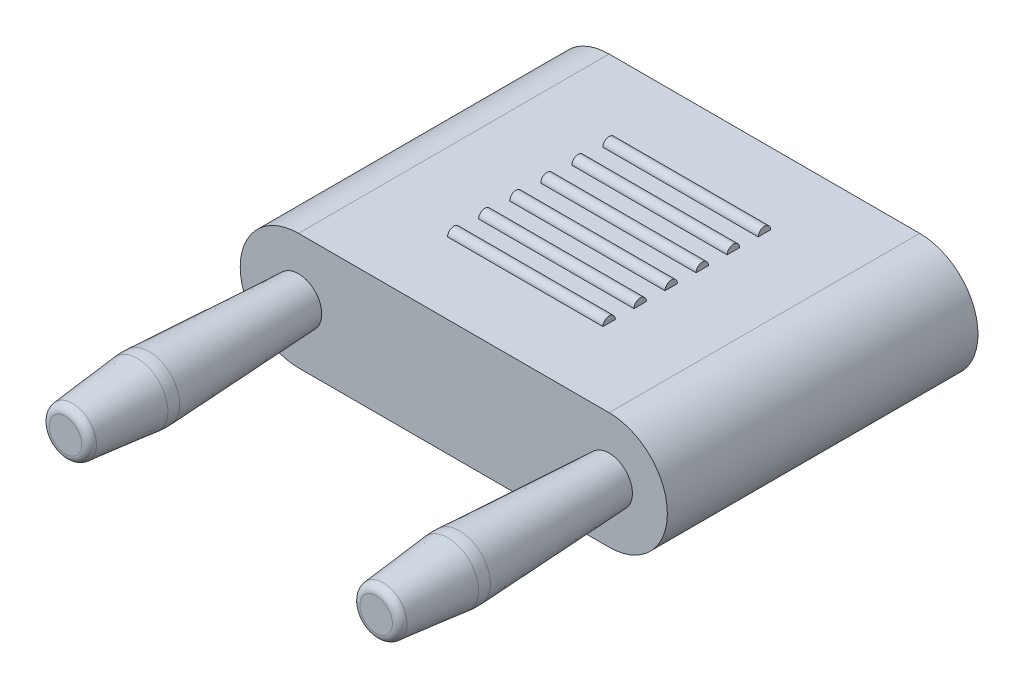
ISO-10303-21;
HEADER;
FILE_DESCRIPTION(('STEP AP214'),'2;1');
FILE_NAME('part.step','',(''),(''),'','','');
FILE_SCHEMA(('AUTOMOTIVE_DESIGN { 1 0 10303 214 1 1 1 1 }'));
ENDSEC;
DATA;
#1=APPLICATION_CONTEXT('core data for automotive mechanical design processes');
#2=APPLICATION_PROTOCOL_DEFINITION('international standard','automotive_design',2000,#1);
#3=PRODUCT_CONTEXT('',#1,'mechanical');
#4=PRODUCT('Part','Part','',(#3));
#5=PRODUCT_RELATED_PRODUCT_CATEGORY('part','',(#4));
#6=PRODUCT_DEFINITION_FORMATION('','',#4);
#7=PRODUCT_DEFINITION_CONTEXT('part definition',#1,'design');
#8=PRODUCT_DEFINITION('design','',#6,#7);
#9=PRODUCT_DEFINITION_SHAPE('','',#8);
#10=(LENGTH_UNIT() NAMED_UNIT(*) SI_UNIT(.MILLI.,.METRE.));
#11=(NAMED_UNIT(*) PLANE_ANGLE_UNIT() SI_UNIT($,.RADIAN.));
#12=(NAMED_UNIT(*) SI_UNIT($,.STERADIAN.) SOLID_ANGLE_UNIT());
#13=UNCERTAINTY_MEASURE_WITH_UNIT(LENGTH_MEASURE(1.E-05),#10,'distance_accuracy_value','');
#14=(GEOMETRIC_REPRESENTATION_CONTEXT(3) GLOBAL_UNCERTAINTY_ASSIGNED_CONTEXT((#13)) GLOBAL_UNIT_ASSIGNED_CONTEXT((#10,
#11,#12)) REPRESENTATION_CONTEXT('',''));
#15=CARTESIAN_POINT('',(0.,0.,0.));
#16=DIRECTION('',(0.,0.,1.));
#17=DIRECTION('',(1.,0.,0.));
#18=AXIS2_PLACEMENT_3D('',#15,#16,#17);
#19=CARTESIAN_POINT('',(-12.7,0.,25.4));
#20=DIRECTION('',(0.,0.,-1.));
#21=DIRECTION('',(-1.,0.,0.));
#22=AXIS2_PLACEMENT_3D('',#19,#20,#21);
#23=CYLINDRICAL_SURFACE('',#22,4.7625);
#24=CARTESIAN_POINT('',(-12.7,0.,0.));
#25=DIRECTION('',(0.,0.,1.));
#26=DIRECTION('',(1.,0.,0.));
#27=AXIS2_PLACEMENT_3D('',#24,#25,#26);
#28=CIRCLE('',#27,4.7625);
#29=CARTESIAN_POINT('',(-12.7,4.7625,0.));
#30=VERTEX_POINT('',#29);
#31=CARTESIAN_POINT('',(-12.7,-4.7625,0.));
#32=VERTEX_POINT('',#31);
#33=EDGE_CURVE('E279',#30,#32,#28,.T.);
#34=ORIENTED_EDGE('',*,*,#33,.T.);
#35=DIRECTION('',(0.,0.,-1.));
#36=VECTOR('',#35,1.);
#37=CARTESIAN_POINT('',(-12.7,-4.7625,25.4));
#38=LINE('',#37,#36);
#39=CARTESIAN_POINT('',(-12.7,-4.7625,25.4));
#40=VERTEX_POINT('',#39);
#41=EDGE_CURVE('E306',#40,#32,#38,.T.);
#42=ORIENTED_EDGE('',*,*,#41,.F.);
#43=CARTESIAN_POINT('',(-12.7,0.,25.4));
#44=DIRECTION('',(0.,0.,1.));
#45=DIRECTION('',(1.,0.,0.));
#46=AXIS2_PLACEMENT_3D('',#43,#44,#45);
#47=CIRCLE('',#46,4.7625);
#48=CARTESIAN_POINT('',(-12.7,4.7625,25.4));
#49=VERTEX_POINT('',#48);
#50=EDGE_CURVE('E280',#49,#40,#47,.T.);
#51=ORIENTED_EDGE('',*,*,#50,.F.);
#52=DIRECTION('',(0.,0.,-1.));
#53=VECTOR('',#52,1.);
#54=CARTESIAN_POINT('',(-12.7,4.7625,25.4));
#55=LINE('',#54,#53);
#56=EDGE_CURVE('E290',#49,#30,#55,.T.);
#57=ORIENTED_EDGE('',*,*,#56,.T.);
#58=EDGE_LOOP('',(#34,#42,#51,#57));
#59=FACE_BOUND('',#58,.T.);
#60=ADVANCED_FACE('F34',(#59),#23,.T.);
#61=CARTESIAN_POINT('',(-12.7,-4.7625,25.4));
#62=DIRECTION('',(0.,1.,0.));
#63=DIRECTION('',(-1.,0.,0.));
#64=AXIS2_PLACEMENT_3D('',#61,#62,#63);
#65=PLANE('',#64);
#66=DIRECTION('',(1.,0.,0.));
#67=VECTOR('',#66,1.);
#68=CARTESIAN_POINT('',(-12.7,-4.7625,0.));
#69=LINE('',#68,#67);
#70=CARTESIAN_POINT('',(12.7,-4.7625,0.));
#71=VERTEX_POINT('',#70);
#72=EDGE_CURVE('E293',#32,#71,#69,.T.);
#73=ORIENTED_EDGE('',*,*,#72,.T.);
#74=DIRECTION('',(0.,0.,-1.));
#75=VECTOR('',#74,1.);
#76=CARTESIAN_POINT('',(12.7,-4.7625,25.4));
#77=LINE('',#76,#75);
#78=CARTESIAN_POINT('',(12.7,-4.7625,25.4));
#79=VERTEX_POINT('',#78);
#80=EDGE_CURVE('E303',#79,#71,#77,.T.);
#81=ORIENTED_EDGE('',*,*,#80,.F.);
#82=DIRECTION('',(1.,0.,0.));
#83=VECTOR('',#82,1.);
#84=CARTESIAN_POINT('',(-12.7,-4.7625,25.4));
#85=LINE('',#84,#83);
#86=EDGE_CURVE('E283',#40,#79,#85,.T.);
#87=ORIENTED_EDGE('',*,*,#86,.F.);
#88=ORIENTED_EDGE('',*,*,#41,.T.);
#89=EDGE_LOOP('',(#73,#81,#87,#88));
#90=FACE_BOUND('',#89,.T.);
#91=ADVANCED_FACE('F327',(#90),#65,.F.);
#92=CARTESIAN_POINT('',(12.7,0.,25.4));
#93=DIRECTION('',(0.,0.,-1.));
#94=DIRECTION('',(-1.,0.,0.));
#95=AXIS2_PLACEMENT_3D('',#92,#93,#94);
#96=CYLINDRICAL_SURFACE('',#95,4.7625);
#97=CARTESIAN_POINT('',(12.7,0.,0.));
#98=DIRECTION('',(0.,0.,1.));
#99=DIRECTION('',(-1.,0.,0.));
#100=AXIS2_PLACEMENT_3D('',#97,#98,#99);
#101=CIRCLE('',#100,4.7625);
#102=CARTESIAN_POINT('',(12.7,4.7625,0.));
#103=VERTEX_POINT('',#102);
#104=EDGE_CURVE('E295',#71,#103,#101,.T.);
#105=ORIENTED_EDGE('',*,*,#104,.T.);
#106=DIRECTION('',(0.,0.,-1.));
#107=VECTOR('',#106,1.);
#108=CARTESIAN_POINT('',(12.7,4.7625,25.4));
#109=LINE('',#108,#107);
#110=CARTESIAN_POINT('',(12.7,4.7625,25.4));
#111=VERTEX_POINT('',#110);
#112=EDGE_CURVE('E300',#111,#103,#109,.T.);
#113=ORIENTED_EDGE('',*,*,#112,.F.);
#114=CARTESIAN_POINT('',(12.7,0.,25.4));
#115=DIRECTION('',(0.,0.,1.));
#116=DIRECTION('',(-1.,0.,0.));
#117=AXIS2_PLACEMENT_3D('',#114,#115,#116);
#118=CIRCLE('',#117,4.7625);
#119=EDGE_CURVE('E286',#79,#111,#118,.T.);
#120=ORIENTED_EDGE('',*,*,#119,.F.);
#121=ORIENTED_EDGE('',*,*,#80,.T.);
#122=EDGE_LOOP('',(#105,#113,#120,#121));
#123=FACE_BOUND('',#122,.T.);
#124=ADVANCED_FACE('F332',(#123),#96,.T.);
#125=CARTESIAN_POINT('',(-12.7,4.7625,25.4));
#126=DIRECTION('',(0.,-1.,0.));
#127=DIRECTION('',(0.,0.,-1.));
#128=AXIS2_PLACEMENT_3D('',#125,#126,#127);
#129=PLANE('',#128);
#130=DIRECTION('',(-1.,0.,0.));
#131=VECTOR('',#130,1.);
#132=CARTESIAN_POINT('',(6.35,4.7625,5.842));
#133=LINE('',#132,#131);
#134=CARTESIAN_POINT('',(6.35,4.7625,5.842));
#135=VERTEX_POINT('',#134);
#136=CARTESIAN_POINT('',(-6.35,4.7625,5.842));
#137=VERTEX_POINT('',#136);
#138=EDGE_CURVE('E53',#135,#137,#133,.T.);
#139=ORIENTED_EDGE('',*,*,#138,.F.);
#140=DIRECTION('',(0.,0.,-1.));
#141=VECTOR('',#140,1.);
#142=CARTESIAN_POINT('',(6.35,4.7625,6.858));
#143=LINE('',#142,#141);
#144=CARTESIAN_POINT('',(6.35,4.7625,6.858));
#145=VERTEX_POINT('',#144);
#146=EDGE_CURVE('E48',#145,#135,#143,.T.);
#147=ORIENTED_EDGE('',*,*,#146,.F.);
#148=DIRECTION('',(-1.,0.,0.));
#149=VECTOR('',#148,1.);
#150=CARTESIAN_POINT('',(6.35,4.7625,6.858));
#151=LINE('',#150,#149);
#152=CARTESIAN_POINT('',(-6.35,4.7625,6.858));
#153=VERTEX_POINT('',#152);
#154=EDGE_CURVE('E142',#145,#153,#151,.T.);
#155=ORIENTED_EDGE('',*,*,#154,.T.);
#156=DIRECTION('',(0.,0.,-1.));
#157=VECTOR('',#156,1.);
#158=CARTESIAN_POINT('',(-6.35,4.7625,6.858));
#159=LINE('',#158,#157);
#160=EDGE_CURVE('E146',#153,#137,#159,.T.);
#161=ORIENTED_EDGE('',*,*,#160,.T.);
#162=EDGE_LOOP('',(#139,#147,#155,#161));
#163=FACE_BOUND('',#162,.T.);
#164=DIRECTION('',(-1.,0.,0.));
#165=VECTOR('',#164,1.);
#166=CARTESIAN_POINT('',(6.35,4.7625,8.382));
#167=LINE('',#166,#165);
#168=CARTESIAN_POINT('',(6.35,4.7625,8.382));
#169=VERTEX_POINT('',#168);
#170=CARTESIAN_POINT('',(-6.35,4.7625,8.382));
#171=VERTEX_POINT('',#170);
#172=EDGE_CURVE('E171',#169,#171,#167,.T.);
#173=ORIENTED_EDGE('',*,*,#172,.F.);
#174=DIRECTION('',(0.,0.,-1.));
#175=VECTOR('',#174,1.);
#176=CARTESIAN_POINT('',(6.35,4.7625,9.39800000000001));
#177=LINE('',#176,#175);
#178=CARTESIAN_POINT('',(6.35,4.7625,9.39800000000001));
#179=VERTEX_POINT('',#178);
#180=EDGE_CURVE('E167',#179,#169,#177,.T.);
#181=ORIENTED_EDGE('',*,*,#180,.F.);
#182=DIRECTION('',(-1.,0.,0.));
#183=VECTOR('',#182,1.);
#184=CARTESIAN_POINT('',(6.35,4.7625,9.39800000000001));
#185=LINE('',#184,#183);
#186=CARTESIAN_POINT('',(-6.35,4.7625,9.39800000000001));
#187=VERTEX_POINT('',#186);
#188=EDGE_CURVE('E177',#179,#187,#185,.T.);
#189=ORIENTED_EDGE('',*,*,#188,.T.);
#190=DIRECTION('',(0.,0.,-1.));
#191=VECTOR('',#190,1.);
#192=CARTESIAN_POINT('',(-6.35,4.7625,9.39800000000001));
#193=LINE('',#192,#191);
#194=EDGE_CURVE('E168',#187,#171,#193,.T.);
#195=ORIENTED_EDGE('',*,*,#194,.T.);
#196=EDGE_LOOP('',(#173,#181,#189,#195));
#197=FACE_BOUND('',#196,.T.);
#198=DIRECTION('',(-1.,0.,0.));
#199=VECTOR('',#198,1.);
#200=CARTESIAN_POINT('',(6.35,4.7625,10.922));
#201=LINE('',#200,#199);
#202=CARTESIAN_POINT('',(6.35,4.7625,10.922));
#203=VERTEX_POINT('',#202);
#204=CARTESIAN_POINT('',(-6.35,4.7625,10.922));
#205=VERTEX_POINT('',#204);
#206=EDGE_CURVE('E187',#203,#205,#201,.T.);
#207=ORIENTED_EDGE('',*,*,#206,.F.);
#208=DIRECTION('',(0.,0.,-1.));
#209=VECTOR('',#208,1.);
#210=CARTESIAN_POINT('',(6.35,4.7625,11.938));
#211=LINE('',#210,#209);
#212=CARTESIAN_POINT('',(6.35,4.7625,11.938));
#213=VERTEX_POINT('',#212);
#214=EDGE_CURVE('E183',#213,#203,#211,.T.);
#215=ORIENTED_EDGE('',*,*,#214,.F.);
#216=DIRECTION('',(-1.,0.,0.));
#217=VECTOR('',#216,1.);
#218=CARTESIAN_POINT('',(6.35,4.7625,11.938));
#219=LINE('',#218,#217);
#220=CARTESIAN_POINT('',(-6.35,4.7625,11.938));
#221=VERTEX_POINT('',#220);
#222=EDGE_CURVE('E193',#213,#221,#219,.T.);
#223=ORIENTED_EDGE('',*,*,#222,.T.);
#224=DIRECTION('',(0.,0.,-1.));
#225=VECTOR('',#224,1.);
#226=CARTESIAN_POINT('',(-6.35,4.7625,11.938));
#227=LINE('',#226,#225);
#228=EDGE_CURVE('E184',#221,#205,#227,.T.);
#229=ORIENTED_EDGE('',*,*,#228,.T.);
#230=EDGE_LOOP('',(#207,#215,#223,#229));
#231=FACE_BOUND('',#230,.T.);
#232=DIRECTION('',(-1.,0.,0.));
#233=VECTOR('',#232,1.);
#234=CARTESIAN_POINT('',(6.35,4.7625,13.462));
#235=LINE('',#234,#233);
#236=CARTESIAN_POINT('',(6.35,4.7625,13.462));
#237=VERTEX_POINT('',#236);
#238=CARTESIAN_POINT('',(-6.35,4.7625,13.462));
#239=VERTEX_POINT('',#238);
#240=EDGE_CURVE('E203',#237,#239,#235,.T.);
#241=ORIENTED_EDGE('',*,*,#240,.F.);
#242=DIRECTION('',(0.,0.,-1.));
#243=VECTOR('',#242,1.);
#244=CARTESIAN_POINT('',(6.35,4.7625,14.478));
#245=LINE('',#244,#243);
#246=CARTESIAN_POINT('',(6.35,4.7625,14.478));
#247=VERTEX_POINT('',#246);
#248=EDGE_CURVE('E199',#247,#237,#245,.T.);
#249=ORIENTED_EDGE('',*,*,#248,.F.);
#250=DIRECTION('',(-1.,0.,0.));
#251=VECTOR('',#250,1.);
#252=CARTESIAN_POINT('',(6.35,4.7625,14.478));
#253=LINE('',#252,#251);
#254=CARTESIAN_POINT('',(-6.35,4.7625,14.478));
#255=VERTEX_POINT('',#254);
#256=EDGE_CURVE('E209',#247,#255,#253,.T.);
#257=ORIENTED_EDGE('',*,*,#256,.T.);
#258=DIRECTION('',(0.,0.,-1.));
#259=VECTOR('',#258,1.);
#260=CARTESIAN_POINT('',(-6.35,4.7625,14.478));
#261=LINE('',#260,#259);
#262=EDGE_CURVE('E200',#255,#239,#261,.T.);
#263=ORIENTED_EDGE('',*,*,#262,.T.);
#264=EDGE_LOOP('',(#241,#249,#257,#263));
#265=FACE_BOUND('',#264,.T.);
#266=DIRECTION('',(-1.,0.,0.));
#267=VECTOR('',#266,1.);
#268=CARTESIAN_POINT('',(6.35,4.7625,16.002));
#269=LINE('',#268,#267);
#270=CARTESIAN_POINT('',(6.35,4.7625,16.002));
#271=VERTEX_POINT('',#270);
#272=CARTESIAN_POINT('',(-6.35,4.7625,16.002));
#273=VERTEX_POINT('',#272);
#274=EDGE_CURVE('E219',#271,#273,#269,.T.);
#275=ORIENTED_EDGE('',*,*,#274,.F.);
#276=DIRECTION('',(0.,0.,-1.));
#277=VECTOR('',#276,1.);
#278=CARTESIAN_POINT('',(6.35,4.7625,17.018));
#279=LINE('',#278,#277);
#280=CARTESIAN_POINT('',(6.35,4.7625,17.018));
#281=VERTEX_POINT('',#280);
#282=EDGE_CURVE('E215',#281,#271,#279,.T.);
#283=ORIENTED_EDGE('',*,*,#282,.F.);
#284=DIRECTION('',(-1.,0.,0.));
#285=VECTOR('',#284,1.);
#286=CARTESIAN_POINT('',(6.35,4.7625,17.018));
#287=LINE('',#286,#285);
#288=CARTESIAN_POINT('',(-6.35,4.7625,17.018));
#289=VERTEX_POINT('',#288);
#290=EDGE_CURVE('E225',#281,#289,#287,.T.);
#291=ORIENTED_EDGE('',*,*,#290,.T.);
#292=DIRECTION('',(0.,0.,-1.));
#293=VECTOR('',#292,1.);
#294=CARTESIAN_POINT('',(-6.35,4.7625,17.018));
#295=LINE('',#294,#293);
#296=EDGE_CURVE('E216',#289,#273,#295,.T.);
#297=ORIENTED_EDGE('',*,*,#296,.T.);
#298=EDGE_LOOP('',(#275,#283,#291,#297));
#299=FACE_BOUND('',#298,.T.);
#300=DIRECTION('',(-1.,0.,0.));
#301=VECTOR('',#300,1.);
#302=CARTESIAN_POINT('',(6.35,4.7625,18.542));
#303=LINE('',#302,#301);
#304=CARTESIAN_POINT('',(6.35,4.7625,18.542));
#305=VERTEX_POINT('',#304);
#306=CARTESIAN_POINT('',(-6.35,4.7625,18.542));
#307=VERTEX_POINT('',#306);
#308=EDGE_CURVE('E235',#305,#307,#303,.T.);
#309=ORIENTED_EDGE('',*,*,#308,.F.);
#310=DIRECTION('',(0.,0.,-1.));
#311=VECTOR('',#310,1.);
#312=CARTESIAN_POINT('',(6.35,4.7625,19.558));
#313=LINE('',#312,#311);
#314=CARTESIAN_POINT('',(6.35,4.7625,19.558));
#315=VERTEX_POINT('',#314);
#316=EDGE_CURVE('E231',#315,#305,#313,.T.);
#317=ORIENTED_EDGE('',*,*,#316,.F.);
#318=DIRECTION('',(-1.,0.,0.));
#319=VECTOR('',#318,1.);
#320=CARTESIAN_POINT('',(6.35,4.7625,19.558));
#321=LINE('',#320,#319);
#322=CARTESIAN_POINT('',(-6.35,4.7625,19.558));
#323=VERTEX_POINT('',#322);
#324=EDGE_CURVE('E241',#315,#323,#321,.T.);
#325=ORIENTED_EDGE('',*,*,#324,.T.);
#326=DIRECTION('',(0.,0.,-1.));
#327=VECTOR('',#326,1.);
#328=CARTESIAN_POINT('',(-6.35,4.7625,19.558));
#329=LINE('',#328,#327);
#330=EDGE_CURVE('E232',#323,#307,#329,.T.);
#331=ORIENTED_EDGE('',*,*,#330,.T.);
#332=EDGE_LOOP('',(#309,#317,#325,#331));
#333=FACE_BOUND('',#332,.T.);
#334=DIRECTION('',(-1.,0.,0.));
#335=VECTOR('',#334,1.);
#336=CARTESIAN_POINT('',(-12.7,4.7625,0.));
#337=LINE('',#336,#335);
#338=EDGE_CURVE('E284',#103,#30,#337,.T.);
#339=ORIENTED_EDGE('',*,*,#338,.T.);
#340=ORIENTED_EDGE('',*,*,#56,.F.);
#341=DIRECTION('',(-1.,0.,0.));
#342=VECTOR('',#341,1.);
#343=CARTESIAN_POINT('',(-12.7,4.7625,25.4));
#344=LINE('',#343,#342);
#345=EDGE_CURVE('E288',#111,#49,#344,.T.);
#346=ORIENTED_EDGE('',*,*,#345,.F.);
#347=ORIENTED_EDGE('',*,*,#112,.T.);
#348=EDGE_LOOP('',(#339,#340,#346,#347));
#349=FACE_BOUND('',#348,.T.);
#350=ADVANCED_FACE('F144',(#163,#197,#231,#265,#299,#333,#349),#129,.F.);
#351=CARTESIAN_POINT('',(-12.7,0.,25.4));
#352=DIRECTION('',(0.,0.,1.));
#353=DIRECTION('',(1.,0.,0.));
#354=AXIS2_PLACEMENT_3D('',#351,#352,#353);
#355=PLANE('',#354);
#356=CARTESIAN_POINT('',(12.7,0.,25.4));
#357=DIRECTION('',(0.,0.,1.));
#358=DIRECTION('',(1.,0.,0.));
#359=AXIS2_PLACEMENT_3D('',#356,#357,#358);
#360=CIRCLE('',#359,1.905);
#361=CARTESIAN_POINT('',(14.605,0.,25.4));
#362=VERTEX_POINT('',#361);
#363=EDGE_CURVE('E11',#362,#362,#360,.T.);
#364=ORIENTED_EDGE('',*,*,#363,.F.);
#365=EDGE_LOOP('',(#364));
#366=FACE_BOUND('',#365,.T.);
#367=CARTESIAN_POINT('',(-12.7,0.,25.4));
#368=DIRECTION('',(0.,0.,1.));
#369=DIRECTION('',(1.,0.,0.));
#370=AXIS2_PLACEMENT_3D('',#367,#368,#369);
#371=CIRCLE('',#370,1.905);
#372=CARTESIAN_POINT('',(-10.795,0.,25.4));
#373=VERTEX_POINT('',#372);
#374=EDGE_CURVE('E41',#373,#373,#371,.T.);
#375=ORIENTED_EDGE('',*,*,#374,.F.);
#376=EDGE_LOOP('',(#375));
#377=FACE_BOUND('',#376,.T.);
#378=ORIENTED_EDGE('',*,*,#50,.T.);
#379=ORIENTED_EDGE('',*,*,#86,.T.);
#380=ORIENTED_EDGE('',*,*,#119,.T.);
#381=ORIENTED_EDGE('',*,*,#345,.T.);
#382=EDGE_LOOP('',(#378,#379,#380,#381));
#383=FACE_BOUND('',#382,.T.);
#384=ADVANCED_FACE('F313',(#366,#377,#383),#355,.T.);
#385=CARTESIAN_POINT('',(-12.7,0.,0.));
#386=DIRECTION('',(0.,0.,1.));
#387=DIRECTION('',(1.,0.,0.));
#388=AXIS2_PLACEMENT_3D('',#385,#386,#387);
#389=PLANE('',#388);
#390=CARTESIAN_POINT('',(12.7,0.,0.));
#391=DIRECTION('',(0.,0.,-1.));
#392=DIRECTION('',(-1.,0.,0.));
#393=AXIS2_PLACEMENT_3D('',#390,#391,#392);
#394=CIRCLE('',#393,1.905);
#395=CARTESIAN_POINT('',(10.795,0.,0.));
#396=VERTEX_POINT('',#395);
#397=EDGE_CURVE('E243',#396,#396,#394,.T.);
#398=ORIENTED_EDGE('',*,*,#397,.F.);
#399=EDGE_LOOP('',(#398));
#400=FACE_BOUND('',#399,.T.);
#401=CARTESIAN_POINT('',(-12.7,0.,0.));
#402=DIRECTION('',(0.,0.,-1.));
#403=DIRECTION('',(-1.,0.,0.));
#404=AXIS2_PLACEMENT_3D('',#401,#402,#403);
#405=CIRCLE('',#404,1.905);
#406=CARTESIAN_POINT('',(-14.605,0.,0.));
#407=VERTEX_POINT('',#406);
#408=EDGE_CURVE('E261',#407,#407,#405,.T.);
#409=ORIENTED_EDGE('',*,*,#408,.F.);
#410=EDGE_LOOP('',(#409));
#411=FACE_BOUND('',#410,.T.);
#412=ORIENTED_EDGE('',*,*,#33,.F.);
#413=ORIENTED_EDGE('',*,*,#338,.F.);
#414=ORIENTED_EDGE('',*,*,#104,.F.);
#415=ORIENTED_EDGE('',*,*,#72,.F.);
#416=EDGE_LOOP('',(#412,#413,#414,#415));
#417=FACE_BOUND('',#416,.T.);
#418=ADVANCED_FACE('F316',(#400,#411,#417),#389,.F.);
#419=CARTESIAN_POINT('',(-14.0303328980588,0.,44.45));
#420=DIRECTION('',(0.,0.,1.));
#421=DIRECTION('',(1.,0.,0.));
#422=AXIS2_PLACEMENT_3D('',#419,#420,#421);
#423=PLANE('',#422);
#424=CARTESIAN_POINT('',(-12.7,0.,44.45));
#425=DIRECTION('',(0.,0.,-1.));
#426=DIRECTION('',(-1.,0.,0.));
#427=AXIS2_PLACEMENT_3D('',#424,#425,#426);
#428=CIRCLE('',#427,1.33033289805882);
#429=CARTESIAN_POINT('',(-14.0303328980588,0.,44.45));
#430=VERTEX_POINT('',#429);
#431=EDGE_CURVE('E276',#430,#430,#428,.T.);
#432=ORIENTED_EDGE('',*,*,#431,.F.);
#433=EDGE_LOOP('',(#432));
#434=FACE_BOUND('',#433,.T.);
#435=ADVANCED_FACE('F337',(#434),#423,.T.);
#436=CARTESIAN_POINT('',(-12.7,0.,43.815));
#437=DIRECTION('',(0.,0.,-1.));
#438=DIRECTION('',(-1.,0.,0.));
#439=AXIS2_PLACEMENT_3D('',#436,#437,#438);
#440=TOROIDAL_SURFACE('',#439,1.33033289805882,0.634999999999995);
#441=ORIENTED_EDGE('',*,*,#431,.T.);
#442=EDGE_LOOP('',(#441));
#443=FACE_BOUND('',#442,.T.);
#444=CARTESIAN_POINT('',(-12.7,0.,43.8781848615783));
#445=DIRECTION('',(0.,0.,-1.));
#446=DIRECTION('',(-1.,0.,0.));
#447=AXIS2_PLACEMENT_3D('',#444,#445,#446);
#448=CIRCLE('',#447,1.96218151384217);
#449=CARTESIAN_POINT('',(-14.6621815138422,0.,43.8781848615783));
#450=VERTEX_POINT('',#449);
#451=EDGE_CURVE('E273',#450,#450,#448,.T.);
#452=ORIENTED_EDGE('',*,*,#451,.F.);
#453=EDGE_LOOP('',(#452));
#454=FACE_BOUND('',#453,.T.);
#455=ADVANCED_FACE('F343',(#443,#454),#440,.T.);
#456=CARTESIAN_POINT('',(-12.7,0.,38.5735921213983));
#457=DIRECTION('',(0.,0.,-1.));
#458=DIRECTION('',(-1.,0.,0.));
#459=AXIS2_PLACEMENT_3D('',#456,#457,#458);
#460=CONICAL_SURFACE('',#459,2.49264078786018,0.099668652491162);
#461=ORIENTED_EDGE('',*,*,#451,.T.);
#462=EDGE_LOOP('',(#461));
#463=FACE_BOUND('',#462,.T.);
#464=CARTESIAN_POINT('',(-12.7,0.,38.5735921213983));
#465=DIRECTION('',(0.,0.,-1.));
#466=DIRECTION('',(-1.,0.,0.));
#467=AXIS2_PLACEMENT_3D('',#464,#465,#466);
#468=CIRCLE('',#467,2.49264078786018);
#469=CARTESIAN_POINT('',(-15.1926407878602,0.,38.5735921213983));
#470=VERTEX_POINT('',#469);
#471=EDGE_CURVE('E270',#470,#470,#468,.T.);
#472=ORIENTED_EDGE('',*,*,#471,.F.);
#473=EDGE_LOOP('',(#472));
#474=FACE_BOUND('',#473,.T.);
#475=ADVANCED_FACE('F644',(#463,#474),#460,.T.);
#476=CARTESIAN_POINT('',(-12.7,0.,37.9417435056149));
#477=DIRECTION('',(0.,0.,-1.));
#478=DIRECTION('',(-1.,0.,0.));
#479=AXIS2_PLACEMENT_3D('',#476,#477,#478);
#480=DEGENERATE_TOROIDAL_SURFACE('',#479,3.82584536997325,6.35,.F.);
#481=ORIENTED_EDGE('',*,*,#471,.T.);
#482=EDGE_LOOP('',(#481));
#483=FACE_BOUND('',#482,.T.);
#484=CARTESIAN_POINT('',(-12.7,0.,37.6246396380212));
#485=DIRECTION('',(0.,0.,-1.));
#486=DIRECTION('',(-1.,0.,0.));
#487=AXIS2_PLACEMENT_3D('',#484,#485,#486);
#488=CIRCLE('',#487,2.51623198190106);
#489=CARTESIAN_POINT('',(-15.2162319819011,0.,37.6246396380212));
#490=VERTEX_POINT('',#489);
#491=EDGE_CURVE('E265',#490,#490,#488,.T.);
#492=ORIENTED_EDGE('',*,*,#491,.F.);
#493=EDGE_LOOP('',(#492));
#494=FACE_BOUND('',#493,.T.);
#495=ADVANCED_FACE('F640',(#483,#494),#480,.F.);
#496=CARTESIAN_POINT('',(-12.7,0.,25.4));
#497=DIRECTION('',(0.,0.,1.));
#498=DIRECTION('',(1.,0.,0.));
#499=AXIS2_PLACEMENT_3D('',#496,#497,#498);
#500=CONICAL_SURFACE('',#499,1.905,0.0499583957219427);
#501=ORIENTED_EDGE('',*,*,#491,.T.);
#502=EDGE_LOOP('',(#501));
#503=FACE_BOUND('',#502,.T.);
#504=ORIENTED_EDGE('',*,*,#374,.T.);
#505=EDGE_LOOP('',(#504));
#506=FACE_BOUND('',#505,.T.);
#507=ADVANCED_FACE('F311',(#503,#506),#500,.T.);
#508=CARTESIAN_POINT('',(-12.7,0.,6.35));
#509=DIRECTION('',(0.,0.,-1.));
#510=DIRECTION('',(-1.,0.,0.));
#511=AXIS2_PLACEMENT_3D('',#508,#509,#510);
#512=CYLINDRICAL_SURFACE('',#511,1.905);
#513=CARTESIAN_POINT('',(-12.7,0.,6.35));
#514=DIRECTION('',(0.,0.,-1.));
#515=DIRECTION('',(-1.,0.,0.));
#516=AXIS2_PLACEMENT_3D('',#513,#514,#515);
#517=CIRCLE('',#516,1.905);
#518=CARTESIAN_POINT('',(-14.605,0.,6.35));
#519=VERTEX_POINT('',#518);
#520=EDGE_CURVE('E262',#519,#519,#517,.T.);
#521=ORIENTED_EDGE('',*,*,#520,.F.);
#522=EDGE_LOOP('',(#521));
#523=FACE_BOUND('',#522,.T.);
#524=ORIENTED_EDGE('',*,*,#408,.T.);
#525=EDGE_LOOP('',(#524));
#526=FACE_BOUND('',#525,.T.);
#527=ADVANCED_FACE('F633',(#523,#526),#512,.F.);
#528=CARTESIAN_POINT('',(-12.7,0.,6.35));
#529=DIRECTION('',(0.,0.,-1.));
#530=DIRECTION('',(-1.,0.,0.));
#531=AXIS2_PLACEMENT_3D('',#528,#529,#530);
#532=PLANE('',#531);
#533=ORIENTED_EDGE('',*,*,#520,.T.);
#534=EDGE_LOOP('',(#533));
#535=FACE_BOUND('',#534,.T.);
#536=ADVANCED_FACE('F374',(#535),#532,.T.);
#537=CARTESIAN_POINT('',(11.3696671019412,0.,44.45));
#538=DIRECTION('',(0.,0.,1.));
#539=DIRECTION('',(1.,0.,0.));
#540=AXIS2_PLACEMENT_3D('',#537,#538,#539);
#541=PLANE('',#540);
#542=CARTESIAN_POINT('',(12.7,0.,44.45));
#543=DIRECTION('',(0.,0.,-1.));
#544=DIRECTION('',(-1.,0.,0.));
#545=AXIS2_PLACEMENT_3D('',#542,#543,#544);
#546=CIRCLE('',#545,1.33033289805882);
#547=CARTESIAN_POINT('',(11.3696671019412,0.,44.45));
#548=VERTEX_POINT('',#547);
#549=EDGE_CURVE('E258',#548,#548,#546,.T.);
#550=ORIENTED_EDGE('',*,*,#549,.F.);
#551=EDGE_LOOP('',(#550));
#552=FACE_BOUND('',#551,.T.);
#553=ADVANCED_FACE('F384',(#552),#541,.T.);
#554=CARTESIAN_POINT('',(12.7,0.,43.815));
#555=DIRECTION('',(0.,0.,-1.));
#556=DIRECTION('',(-1.,0.,0.));
#557=AXIS2_PLACEMENT_3D('',#554,#555,#556);
#558=TOROIDAL_SURFACE('',#557,1.33033289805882,0.634999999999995);
#559=ORIENTED_EDGE('',*,*,#549,.T.);
#560=EDGE_LOOP('',(#559));
#561=FACE_BOUND('',#560,.T.);
#562=CARTESIAN_POINT('',(12.7,0.,43.8781848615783));
#563=DIRECTION('',(0.,0.,-1.));
#564=DIRECTION('',(-1.,0.,0.));
#565=AXIS2_PLACEMENT_3D('',#562,#563,#564);
#566=CIRCLE('',#565,1.96218151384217);
#567=CARTESIAN_POINT('',(10.7378184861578,0.,43.8781848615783));
#568=VERTEX_POINT('',#567);
#569=EDGE_CURVE('E255',#568,#568,#566,.T.);
#570=ORIENTED_EDGE('',*,*,#569,.F.);
#571=EDGE_LOOP('',(#570));
#572=FACE_BOUND('',#571,.T.);
#573=ADVANCED_FACE('F389',(#561,#572),#558,.T.);
#574=CARTESIAN_POINT('',(12.7,0.,38.5735921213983));
#575=DIRECTION('',(0.,0.,-1.));
#576=DIRECTION('',(-1.,0.,0.));
#577=AXIS2_PLACEMENT_3D('',#574,#575,#576);
#578=CONICAL_SURFACE('',#577,2.49264078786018,0.099668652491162);
#579=ORIENTED_EDGE('',*,*,#569,.T.);
#580=EDGE_LOOP('',(#579));
#581=FACE_BOUND('',#580,.T.);
#582=CARTESIAN_POINT('',(12.7,0.,38.5735921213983));
#583=DIRECTION('',(0.,0.,-1.));
#584=DIRECTION('',(-1.,0.,0.));
#585=AXIS2_PLACEMENT_3D('',#582,#583,#584);
#586=CIRCLE('',#585,2.49264078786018);
#587=CARTESIAN_POINT('',(10.2073592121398,0.,38.5735921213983));
#588=VERTEX_POINT('',#587);
#589=EDGE_CURVE('E252',#588,#588,#586,.T.);
#590=ORIENTED_EDGE('',*,*,#589,.F.);
#591=EDGE_LOOP('',(#590));
#592=FACE_BOUND('',#591,.T.);
#593=ADVANCED_FACE('F400',(#581,#592),#578,.T.);
#594=CARTESIAN_POINT('',(12.7,0.,37.9417435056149));
#595=DIRECTION('',(0.,0.,-1.));
#596=DIRECTION('',(-1.,0.,0.));
#597=AXIS2_PLACEMENT_3D('',#594,#595,#596);
#598=DEGENERATE_TOROIDAL_SURFACE('',#597,3.82584536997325,6.35,.F.);
#599=ORIENTED_EDGE('',*,*,#589,.T.);
#600=EDGE_LOOP('',(#599));
#601=FACE_BOUND('',#600,.T.);
#602=CARTESIAN_POINT('',(12.7,0.,37.6246396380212));
#603=DIRECTION('',(0.,0.,-1.));
#604=DIRECTION('',(-1.,0.,0.));
#605=AXIS2_PLACEMENT_3D('',#602,#603,#604);
#606=CIRCLE('',#605,2.51623198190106);
#607=CARTESIAN_POINT('',(10.1837680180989,0.,37.6246396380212));
#608=VERTEX_POINT('',#607);
#609=EDGE_CURVE('E247',#608,#608,#606,.T.);
#610=ORIENTED_EDGE('',*,*,#609,.F.);
#611=EDGE_LOOP('',(#610));
#612=FACE_BOUND('',#611,.T.);
#613=ADVANCED_FACE('F410',(#601,#612),#598,.F.);
#614=CARTESIAN_POINT('',(12.7,0.,25.4));
#615=DIRECTION('',(0.,0.,1.));
#616=DIRECTION('',(1.,0.,0.));
#617=AXIS2_PLACEMENT_3D('',#614,#615,#616);
#618=CONICAL_SURFACE('',#617,1.905,0.0499583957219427);
#619=ORIENTED_EDGE('',*,*,#609,.T.);
#620=EDGE_LOOP('',(#619));
#621=FACE_BOUND('',#620,.T.);
#622=ORIENTED_EDGE('',*,*,#363,.T.);
#623=EDGE_LOOP('',(#622));
#624=FACE_BOUND('',#623,.T.);
#625=ADVANCED_FACE('F420',(#621,#624),#618,.T.);
#626=CARTESIAN_POINT('',(12.7,0.,6.35));
#627=DIRECTION('',(0.,0.,-1.));
#628=DIRECTION('',(-1.,0.,0.));
#629=AXIS2_PLACEMENT_3D('',#626,#627,#628);
#630=CYLINDRICAL_SURFACE('',#629,1.905);
#631=CARTESIAN_POINT('',(12.7,0.,6.35));
#632=DIRECTION('',(0.,0.,-1.));
#633=DIRECTION('',(-1.,0.,0.));
#634=AXIS2_PLACEMENT_3D('',#631,#632,#633);
#635=CIRCLE('',#634,1.905);
#636=CARTESIAN_POINT('',(10.795,0.,6.35));
#637=VERTEX_POINT('',#636);
#638=EDGE_CURVE('E244',#637,#637,#635,.T.);
#639=ORIENTED_EDGE('',*,*,#638,.F.);
#640=EDGE_LOOP('',(#639));
#641=FACE_BOUND('',#640,.T.);
#642=ORIENTED_EDGE('',*,*,#397,.T.);
#643=EDGE_LOOP('',(#642));
#644=FACE_BOUND('',#643,.T.);
#645=ADVANCED_FACE('F430',(#641,#644),#630,.F.);
#646=CARTESIAN_POINT('',(12.7,0.,6.35));
#647=DIRECTION('',(0.,0.,-1.));
#648=DIRECTION('',(-1.,0.,0.));
#649=AXIS2_PLACEMENT_3D('',#646,#647,#648);
#650=PLANE('',#649);
#651=ORIENTED_EDGE('',*,*,#638,.T.);
#652=EDGE_LOOP('',(#651));
#653=FACE_BOUND('',#652,.T.);
#654=ADVANCED_FACE('F441',(#653),#650,.T.);
#655=CARTESIAN_POINT('',(6.35,4.7625,19.05));
#656=DIRECTION('',(-1.,0.,0.));
#657=DIRECTION('',(0.,0.,1.));
#658=AXIS2_PLACEMENT_3D('',#655,#656,#657);
#659=CYLINDRICAL_SURFACE('',#658,0.508000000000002);
#660=CARTESIAN_POINT('',(-6.35,4.7625,19.05));
#661=DIRECTION('',(1.,0.,0.));
#662=DIRECTION('',(0.,0.,-1.));
#663=AXIS2_PLACEMENT_3D('',#660,#661,#662);
#664=CIRCLE('',#663,0.508000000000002);
#665=EDGE_CURVE('E227',#307,#323,#664,.T.);
#666=ORIENTED_EDGE('',*,*,#665,.T.);
#667=ORIENTED_EDGE('',*,*,#324,.F.);
#668=CARTESIAN_POINT('',(6.35,4.7625,19.05));
#669=DIRECTION('',(1.,0.,0.));
#670=DIRECTION('',(0.,0.,-1.));
#671=AXIS2_PLACEMENT_3D('',#668,#669,#670);
#672=CIRCLE('',#671,0.508000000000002);
#673=EDGE_CURVE('E228',#305,#315,#672,.T.);
#674=ORIENTED_EDGE('',*,*,#673,.F.);
#675=ORIENTED_EDGE('',*,*,#308,.T.);
#676=EDGE_LOOP('',(#666,#667,#674,#675));
#677=FACE_BOUND('',#676,.T.);
#678=ADVANCED_FACE('F452',(#677),#659,.T.);
#679=CARTESIAN_POINT('',(6.35,4.7625,19.05));
#680=DIRECTION('',(1.,0.,0.));
#681=DIRECTION('',(0.,0.,-1.));
#682=AXIS2_PLACEMENT_3D('',#679,#680,#681);
#683=PLANE('',#682);
#684=ORIENTED_EDGE('',*,*,#673,.T.);
#685=ORIENTED_EDGE('',*,*,#316,.T.);
#686=EDGE_LOOP('',(#684,#685));
#687=FACE_BOUND('',#686,.T.);
#688=ADVANCED_FACE('F463',(#687),#683,.T.);
#689=CARTESIAN_POINT('',(-6.35,4.7625,19.05));
#690=DIRECTION('',(1.,0.,0.));
#691=DIRECTION('',(0.,0.,-1.));
#692=AXIS2_PLACEMENT_3D('',#689,#690,#691);
#693=PLANE('',#692);
#694=ORIENTED_EDGE('',*,*,#665,.F.);
#695=ORIENTED_EDGE('',*,*,#330,.F.);
#696=EDGE_LOOP('',(#694,#695));
#697=FACE_BOUND('',#696,.T.);
#698=ADVANCED_FACE('F472',(#697),#693,.F.);
#699=CARTESIAN_POINT('',(6.35,4.7625,16.51));
#700=DIRECTION('',(-1.,0.,0.));
#701=DIRECTION('',(0.,0.,1.));
#702=AXIS2_PLACEMENT_3D('',#699,#700,#701);
#703=CYLINDRICAL_SURFACE('',#702,0.508000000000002);
#704=CARTESIAN_POINT('',(-6.35,4.7625,16.51));
#705=DIRECTION('',(1.,0.,0.));
#706=DIRECTION('',(0.,0.,-1.));
#707=AXIS2_PLACEMENT_3D('',#704,#705,#706);
#708=CIRCLE('',#707,0.508000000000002);
#709=EDGE_CURVE('E211',#273,#289,#708,.T.);
#710=ORIENTED_EDGE('',*,*,#709,.T.);
#711=ORIENTED_EDGE('',*,*,#290,.F.);
#712=CARTESIAN_POINT('',(6.35,4.7625,16.51));
#713=DIRECTION('',(1.,0.,0.));
#714=DIRECTION('',(0.,0.,-1.));
#715=AXIS2_PLACEMENT_3D('',#712,#713,#714);
#716=CIRCLE('',#715,0.508000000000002);
#717=EDGE_CURVE('E212',#271,#281,#716,.T.);
#718=ORIENTED_EDGE('',*,*,#717,.F.);
#719=ORIENTED_EDGE('',*,*,#274,.T.);
#720=EDGE_LOOP('',(#710,#711,#718,#719));
#721=FACE_BOUND('',#720,.T.);
#722=ADVANCED_FACE('F481',(#721),#703,.T.);
#723=CARTESIAN_POINT('',(6.35,4.7625,16.51));
#724=DIRECTION('',(1.,0.,0.));
#725=DIRECTION('',(0.,0.,-1.));
#726=AXIS2_PLACEMENT_3D('',#723,#724,#725);
#727=PLANE('',#726);
#728=ORIENTED_EDGE('',*,*,#717,.T.);
#729=ORIENTED_EDGE('',*,*,#282,.T.);
#730=EDGE_LOOP('',(#728,#729));
#731=FACE_BOUND('',#730,.T.);
#732=ADVANCED_FACE('F491',(#731),#727,.T.);
#733=CARTESIAN_POINT('',(-6.35,4.7625,16.51));
#734=DIRECTION('',(1.,0.,0.));
#735=DIRECTION('',(0.,0.,-1.));
#736=AXIS2_PLACEMENT_3D('',#733,#734,#735);
#737=PLANE('',#736);
#738=ORIENTED_EDGE('',*,*,#709,.F.);
#739=ORIENTED_EDGE('',*,*,#296,.F.);
#740=EDGE_LOOP('',(#738,#739));
#741=FACE_BOUND('',#740,.T.);
#742=ADVANCED_FACE('F498',(#741),#737,.F.);
#743=CARTESIAN_POINT('',(6.35,4.7625,13.97));
#744=DIRECTION('',(-1.,0.,0.));
#745=DIRECTION('',(0.,0.,1.));
#746=AXIS2_PLACEMENT_3D('',#743,#744,#745);
#747=CYLINDRICAL_SURFACE('',#746,0.508000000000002);
#748=CARTESIAN_POINT('',(-6.35,4.7625,13.97));
#749=DIRECTION('',(1.,0.,0.));
#750=DIRECTION('',(0.,0.,-1.));
#751=AXIS2_PLACEMENT_3D('',#748,#749,#750);
#752=CIRCLE('',#751,0.508000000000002);
#753=EDGE_CURVE('E195',#239,#255,#752,.T.);
#754=ORIENTED_EDGE('',*,*,#753,.T.);
#755=ORIENTED_EDGE('',*,*,#256,.F.);
#756=CARTESIAN_POINT('',(6.35,4.7625,13.97));
#757=DIRECTION('',(1.,0.,0.));
#758=DIRECTION('',(0.,0.,-1.));
#759=AXIS2_PLACEMENT_3D('',#756,#757,#758);
#760=CIRCLE('',#759,0.508000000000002);
#761=EDGE_CURVE('E196',#237,#247,#760,.T.);
#762=ORIENTED_EDGE('',*,*,#761,.F.);
#763=ORIENTED_EDGE('',*,*,#240,.T.);
#764=EDGE_LOOP('',(#754,#755,#762,#763));
#765=FACE_BOUND('',#764,.T.);
#766=ADVANCED_FACE('F506',(#765),#747,.T.);
#767=CARTESIAN_POINT('',(6.35,4.7625,13.97));
#768=DIRECTION('',(1.,0.,0.));
#769=DIRECTION('',(0.,0.,-1.));
#770=AXIS2_PLACEMENT_3D('',#767,#768,#769);
#771=PLANE('',#770);
#772=ORIENTED_EDGE('',*,*,#761,.T.);
#773=ORIENTED_EDGE('',*,*,#248,.T.);
#774=EDGE_LOOP('',(#772,#773));
#775=FACE_BOUND('',#774,.T.);
#776=ADVANCED_FACE('F514',(#775),#771,.T.);
#777=CARTESIAN_POINT('',(-6.35,4.7625,13.97));
#778=DIRECTION('',(1.,0.,0.));
#779=DIRECTION('',(0.,0.,-1.));
#780=AXIS2_PLACEMENT_3D('',#777,#778,#779);
#781=PLANE('',#780);
#782=ORIENTED_EDGE('',*,*,#753,.F.);
#783=ORIENTED_EDGE('',*,*,#262,.F.);
#784=EDGE_LOOP('',(#782,#783));
#785=FACE_BOUND('',#784,.T.);
#786=ADVANCED_FACE('F522',(#785),#781,.F.);
#787=CARTESIAN_POINT('',(6.35,4.7625,11.43));
#788=DIRECTION('',(-1.,0.,0.));
#789=DIRECTION('',(0.,0.,1.));
#790=AXIS2_PLACEMENT_3D('',#787,#788,#789);
#791=CYLINDRICAL_SURFACE('',#790,0.508000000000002);
#792=CARTESIAN_POINT('',(-6.35,4.7625,11.43));
#793=DIRECTION('',(1.,0.,0.));
#794=DIRECTION('',(0.,0.,-1.));
#795=AXIS2_PLACEMENT_3D('',#792,#793,#794);
#796=CIRCLE('',#795,0.508000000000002);
#797=EDGE_CURVE('E179',#205,#221,#796,.T.);
#798=ORIENTED_EDGE('',*,*,#797,.T.);
#799=ORIENTED_EDGE('',*,*,#222,.F.);
#800=CARTESIAN_POINT('',(6.35,4.7625,11.43));
#801=DIRECTION('',(1.,0.,0.));
#802=DIRECTION('',(0.,0.,-1.));
#803=AXIS2_PLACEMENT_3D('',#800,#801,#802);
#804=CIRCLE('',#803,0.508000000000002);
#805=EDGE_CURVE('E180',#203,#213,#804,.T.);
#806=ORIENTED_EDGE('',*,*,#805,.F.);
#807=ORIENTED_EDGE('',*,*,#206,.T.);
#808=EDGE_LOOP('',(#798,#799,#806,#807));
#809=FACE_BOUND('',#808,.T.);
#810=ADVANCED_FACE('F530',(#809),#791,.T.);
#811=CARTESIAN_POINT('',(6.35,4.7625,11.43));
#812=DIRECTION('',(1.,0.,0.));
#813=DIRECTION('',(0.,0.,-1.));
#814=AXIS2_PLACEMENT_3D('',#811,#812,#813);
#815=PLANE('',#814);
#816=ORIENTED_EDGE('',*,*,#805,.T.);
#817=ORIENTED_EDGE('',*,*,#214,.T.);
#818=EDGE_LOOP('',(#816,#817));
#819=FACE_BOUND('',#818,.T.);
#820=ADVANCED_FACE('F538',(#819),#815,.T.);
#821=CARTESIAN_POINT('',(-6.35,4.7625,11.43));
#822=DIRECTION('',(1.,0.,0.));
#823=DIRECTION('',(0.,0.,-1.));
#824=AXIS2_PLACEMENT_3D('',#821,#822,#823);
#825=PLANE('',#824);
#826=ORIENTED_EDGE('',*,*,#797,.F.);
#827=ORIENTED_EDGE('',*,*,#228,.F.);
#828=EDGE_LOOP('',(#826,#827));
#829=FACE_BOUND('',#828,.T.);
#830=ADVANCED_FACE('F546',(#829),#825,.F.);
#831=CARTESIAN_POINT('',(6.35,4.7625,8.89));
#832=DIRECTION('',(-1.,0.,0.));
#833=DIRECTION('',(0.,0.,1.));
#834=AXIS2_PLACEMENT_3D('',#831,#832,#833);
#835=CYLINDRICAL_SURFACE('',#834,0.508000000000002);
#836=CARTESIAN_POINT('',(-6.35,4.7625,8.89));
#837=DIRECTION('',(1.,0.,0.));
#838=DIRECTION('',(0.,0.,-1.));
#839=AXIS2_PLACEMENT_3D('',#836,#837,#838);
#840=CIRCLE('',#839,0.508000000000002);
#841=EDGE_CURVE('E150',#171,#187,#840,.T.);
#842=ORIENTED_EDGE('',*,*,#841,.T.);
#843=ORIENTED_EDGE('',*,*,#188,.F.);
#844=CARTESIAN_POINT('',(6.35,4.7625,8.89));
#845=DIRECTION('',(1.,0.,0.));
#846=DIRECTION('',(0.,0.,-1.));
#847=AXIS2_PLACEMENT_3D('',#844,#845,#846);
#848=CIRCLE('',#847,0.508000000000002);
#849=EDGE_CURVE('E164',#169,#179,#848,.T.);
#850=ORIENTED_EDGE('',*,*,#849,.F.);
#851=ORIENTED_EDGE('',*,*,#172,.T.);
#852=EDGE_LOOP('',(#842,#843,#850,#851));
#853=FACE_BOUND('',#852,.T.);
#854=ADVANCED_FACE('F554',(#853),#835,.T.);
#855=CARTESIAN_POINT('',(6.35,4.7625,8.89));
#856=DIRECTION('',(1.,0.,0.));
#857=DIRECTION('',(0.,0.,-1.));
#858=AXIS2_PLACEMENT_3D('',#855,#856,#857);
#859=PLANE('',#858);
#860=ORIENTED_EDGE('',*,*,#849,.T.);
#861=ORIENTED_EDGE('',*,*,#180,.T.);
#862=EDGE_LOOP('',(#860,#861));
#863=FACE_BOUND('',#862,.T.);
#864=ADVANCED_FACE('F562',(#863),#859,.T.);
#865=CARTESIAN_POINT('',(-6.35,4.7625,8.89));
#866=DIRECTION('',(1.,0.,0.));
#867=DIRECTION('',(0.,0.,-1.));
#868=AXIS2_PLACEMENT_3D('',#865,#866,#867);
#869=PLANE('',#868);
#870=ORIENTED_EDGE('',*,*,#841,.F.);
#871=ORIENTED_EDGE('',*,*,#194,.F.);
#872=EDGE_LOOP('',(#870,#871));
#873=FACE_BOUND('',#872,.T.);
#874=ADVANCED_FACE('F570',(#873),#869,.F.);
#875=CARTESIAN_POINT('',(6.35,4.7625,6.35));
#876=DIRECTION('',(-1.,0.,0.));
#877=DIRECTION('',(0.,0.,1.));
#878=AXIS2_PLACEMENT_3D('',#875,#876,#877);
#879=CYLINDRICAL_SURFACE('',#878,0.508000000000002);
#880=CARTESIAN_POINT('',(-6.35,4.7625,6.35));
#881=DIRECTION('',(1.,0.,0.));
#882=DIRECTION('',(0.,0.,-1.));
#883=AXIS2_PLACEMENT_3D('',#880,#881,#882);
#884=CIRCLE('',#883,0.508000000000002);
#885=EDGE_CURVE('E155',#137,#153,#884,.T.);
#886=ORIENTED_EDGE('',*,*,#885,.T.);
#887=ORIENTED_EDGE('',*,*,#154,.F.);
#888=CARTESIAN_POINT('',(6.35,4.7625,6.35));
#889=DIRECTION('',(1.,0.,0.));
#890=DIRECTION('',(0.,0.,-1.));
#891=AXIS2_PLACEMENT_3D('',#888,#889,#890);
#892=CIRCLE('',#891,0.508000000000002);
#893=EDGE_CURVE('E156',#135,#145,#892,.T.);
#894=ORIENTED_EDGE('',*,*,#893,.F.);
#895=ORIENTED_EDGE('',*,*,#138,.T.);
#896=EDGE_LOOP('',(#886,#887,#894,#895));
#897=FACE_BOUND('',#896,.T.);
#898=ADVANCED_FACE('F158',(#897),#879,.T.);
#899=CARTESIAN_POINT('',(6.35,4.7625,6.35));
#900=DIRECTION('',(1.,0.,0.));
#901=DIRECTION('',(0.,0.,-1.));
#902=AXIS2_PLACEMENT_3D('',#899,#900,#901);
#903=PLANE('',#902);
#904=ORIENTED_EDGE('',*,*,#893,.T.);
#905=ORIENTED_EDGE('',*,*,#146,.T.);
#906=EDGE_LOOP('',(#904,#905));
#907=FACE_BOUND('',#906,.T.);
#908=ADVANCED_FACE('F585',(#907),#903,.T.);
#909=CARTESIAN_POINT('',(-6.35,4.7625,6.35));
#910=DIRECTION('',(1.,0.,0.));
#911=DIRECTION('',(0.,0.,-1.));
#912=AXIS2_PLACEMENT_3D('',#909,#910,#911);
#913=PLANE('',#912);
#914=ORIENTED_EDGE('',*,*,#885,.F.);
#915=ORIENTED_EDGE('',*,*,#160,.F.);
#916=EDGE_LOOP('',(#914,#915));
#917=FACE_BOUND('',#916,.T.);
#918=ADVANCED_FACE('F154',(#917),#913,.F.);
#919=CLOSED_SHELL('',(#60,#91,#124,#350,#384,#418,#435,#455,#475,#495,#507,#527,#536,#553,#573,
#593,#613,#625,#645,#654,#678,#688,#698,#722,#732,#742,#766,#776,#786,#810,#820,#830,#854,#864,
#874,#898,#908,#918));
#920=MANIFOLD_SOLID_BREP('B2',#919);
#921=ADVANCED_BREP_SHAPE_REPRESENTATION('',(#18,#920),#14);
#922=SHAPE_DEFINITION_REPRESENTATION(#9,#921);
ENDSEC;
END-ISO-10303-21;
